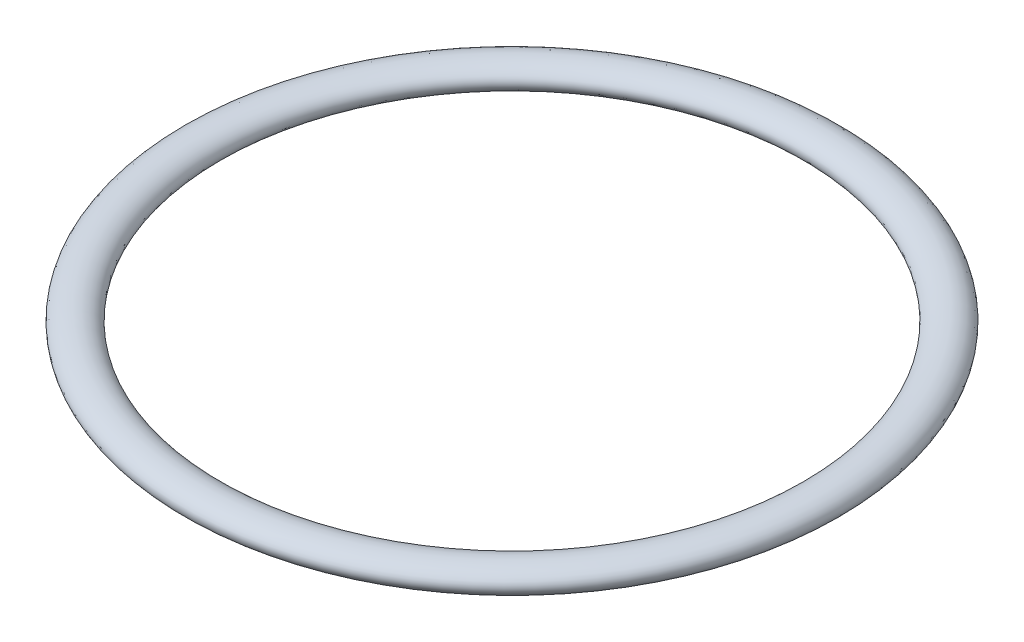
ISO-10303-21;
HEADER;
FILE_DESCRIPTION(('STEP AP214'),'2;1');
FILE_NAME('part.step','',(''),(''),'','','');
FILE_SCHEMA(('AUTOMOTIVE_DESIGN { 1 0 10303 214 1 1 1 1 }'));
ENDSEC;
DATA;
#1=APPLICATION_CONTEXT('core data for automotive mechanical design processes');
#2=APPLICATION_PROTOCOL_DEFINITION('international standard','automotive_design',2000,#1);
#3=PRODUCT_CONTEXT('',#1,'mechanical');
#4=PRODUCT('Part','Part','',(#3));
#5=PRODUCT_RELATED_PRODUCT_CATEGORY('part','',(#4));
#6=PRODUCT_DEFINITION_FORMATION('','',#4);
#7=PRODUCT_DEFINITION_CONTEXT('part definition',#1,'design');
#8=PRODUCT_DEFINITION('design','',#6,#7);
#9=PRODUCT_DEFINITION_SHAPE('','',#8);
#10=(LENGTH_UNIT() NAMED_UNIT(*) SI_UNIT(.MILLI.,.METRE.));
#11=(NAMED_UNIT(*) PLANE_ANGLE_UNIT() SI_UNIT($,.RADIAN.));
#12=(NAMED_UNIT(*) SI_UNIT($,.STERADIAN.) SOLID_ANGLE_UNIT());
#13=UNCERTAINTY_MEASURE_WITH_UNIT(LENGTH_MEASURE(1.E-05),#10,'distance_accuracy_value','');
#14=(GEOMETRIC_REPRESENTATION_CONTEXT(3) GLOBAL_UNCERTAINTY_ASSIGNED_CONTEXT((#13)) GLOBAL_UNIT_ASSIGNED_CONTEXT((#10,
#11,#12)) REPRESENTATION_CONTEXT('',''));
#15=CARTESIAN_POINT('',(0.,0.,0.));
#16=DIRECTION('',(0.,0.,1.));
#17=DIRECTION('',(1.,0.,0.));
#18=AXIS2_PLACEMENT_3D('',#15,#16,#17);
#19=CARTESIAN_POINT('',(-63.5,-2.6,0.));
#20=DIRECTION('',(0.,0.,1.));
#21=DIRECTION('',(-1.,0.,0.));
#22=AXIS2_PLACEMENT_3D('',#19,#20,#21);
#23=ELLIPSE('',#22,4.22261390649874,2.6);
#24=CARTESIAN_POINT('',(0.,51.6737551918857,0.));
#25=DIRECTION('',(0.,1.,0.));
#26=AXIS1_PLACEMENT('',#24,#25);
#27=SURFACE_OF_REVOLUTION('',#23,#26);
#28=ADVANCED_FACE('F439',(),#27,.F.);
#29=CLOSED_SHELL('',(#28));
#30=MANIFOLD_SOLID_BREP('B2',#29);
#31=ADVANCED_BREP_SHAPE_REPRESENTATION('',(#18,#30),#14);
#32=SHAPE_DEFINITION_REPRESENTATION(#9,#31);
ENDSEC;
END-ISO-10303-21;
